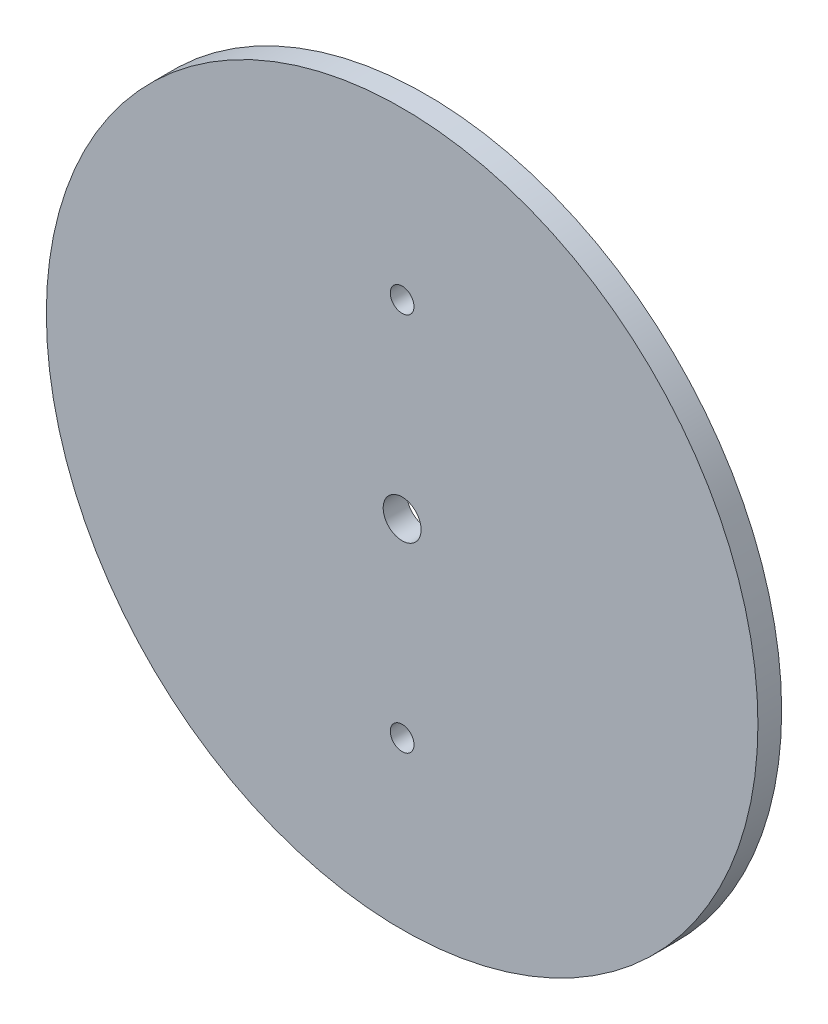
ISO-10303-21;
HEADER;
FILE_DESCRIPTION(('STEP AP214'),'2;1');
FILE_NAME('part.step','',(''),(''),'','','');
FILE_SCHEMA(('AUTOMOTIVE_DESIGN { 1 0 10303 214 1 1 1 1 }'));
ENDSEC;
DATA;
#1=APPLICATION_CONTEXT('core data for automotive mechanical design processes');
#2=APPLICATION_PROTOCOL_DEFINITION('international standard','automotive_design',2000,#1);
#3=PRODUCT_CONTEXT('',#1,'mechanical');
#4=PRODUCT('Part','Part','',(#3));
#5=PRODUCT_RELATED_PRODUCT_CATEGORY('part','',(#4));
#6=PRODUCT_DEFINITION_FORMATION('','',#4);
#7=PRODUCT_DEFINITION_CONTEXT('part definition',#1,'design');
#8=PRODUCT_DEFINITION('design','',#6,#7);
#9=PRODUCT_DEFINITION_SHAPE('','',#8);
#10=(LENGTH_UNIT() NAMED_UNIT(*) SI_UNIT(.MILLI.,.METRE.));
#11=(NAMED_UNIT(*) PLANE_ANGLE_UNIT() SI_UNIT($,.RADIAN.));
#12=(NAMED_UNIT(*) SI_UNIT($,.STERADIAN.) SOLID_ANGLE_UNIT());
#13=UNCERTAINTY_MEASURE_WITH_UNIT(LENGTH_MEASURE(1.E-05),#10,'distance_accuracy_value','');
#14=(GEOMETRIC_REPRESENTATION_CONTEXT(3) GLOBAL_UNCERTAINTY_ASSIGNED_CONTEXT((#13)) GLOBAL_UNIT_ASSIGNED_CONTEXT((#10,
#11,#12)) REPRESENTATION_CONTEXT('',''));
#15=CARTESIAN_POINT('',(0.,0.,0.));
#16=DIRECTION('',(0.,0.,1.));
#17=DIRECTION('',(1.,0.,0.));
#18=AXIS2_PLACEMENT_3D('',#15,#16,#17);
#19=CARTESIAN_POINT('',(0.,0.,65.));
#20=DIRECTION('',(0.,0.,1.));
#21=DIRECTION('',(1.,0.,0.));
#22=AXIS2_PLACEMENT_3D('',#19,#20,#21);
#23=CYLINDRICAL_SURFACE('',#22,75.);
#24=CARTESIAN_POINT('',(0.,0.,65.));
#25=DIRECTION('',(0.,0.,1.));
#26=DIRECTION('',(1.,0.,0.));
#27=AXIS2_PLACEMENT_3D('',#24,#25,#26);
#28=CIRCLE('',#27,75.);
#29=CARTESIAN_POINT('',(75.,0.,65.));
#30=VERTEX_POINT('',#29);
#31=EDGE_CURVE('E10',#30,#30,#28,.T.);
#32=ORIENTED_EDGE('',*,*,#31,.T.);
#33=EDGE_LOOP('',(#32));
#34=FACE_BOUND('',#33,.T.);
#35=CARTESIAN_POINT('',(0.,0.,70.));
#36=DIRECTION('',(0.,0.,1.));
#37=DIRECTION('',(1.,0.,0.));
#38=AXIS2_PLACEMENT_3D('',#35,#36,#37);
#39=CIRCLE('',#38,75.);
#40=CARTESIAN_POINT('',(75.,0.,70.));
#41=VERTEX_POINT('',#40);
#42=EDGE_CURVE('E40',#41,#41,#39,.T.);
#43=ORIENTED_EDGE('',*,*,#42,.F.);
#44=EDGE_LOOP('',(#43));
#45=FACE_BOUND('',#44,.T.);
#46=ADVANCED_FACE('F32',(#34,#45),#23,.T.);
#47=CARTESIAN_POINT('',(0.,0.,65.));
#48=DIRECTION('',(0.,0.,1.));
#49=DIRECTION('',(1.,0.,0.));
#50=AXIS2_PLACEMENT_3D('',#47,#48,#49);
#51=PLANE('',#50);
#52=CARTESIAN_POINT('',(0.,0.,65.));
#53=DIRECTION('',(0.,0.,-1.));
#54=DIRECTION('',(-1.,0.,0.));
#55=AXIS2_PLACEMENT_3D('',#52,#53,#54);
#56=CIRCLE('',#55,4.);
#57=CARTESIAN_POINT('',(-4.,0.,65.));
#58=VERTEX_POINT('',#57);
#59=EDGE_CURVE('E58',#58,#58,#56,.T.);
#60=ORIENTED_EDGE('',*,*,#59,.F.);
#61=EDGE_LOOP('',(#60));
#62=FACE_BOUND('',#61,.T.);
#63=CARTESIAN_POINT('',(0.,-40.,65.));
#64=DIRECTION('',(0.,0.,1.));
#65=DIRECTION('',(1.,0.,0.));
#66=AXIS2_PLACEMENT_3D('',#63,#64,#65);
#67=CIRCLE('',#66,2.5);
#68=CARTESIAN_POINT('',(2.5,-40.,65.));
#69=VERTEX_POINT('',#68);
#70=EDGE_CURVE('E52',#69,#69,#67,.F.);
#71=ORIENTED_EDGE('',*,*,#70,.F.);
#72=EDGE_LOOP('',(#71));
#73=FACE_BOUND('',#72,.T.);
#74=CARTESIAN_POINT('',(0.,40.,65.));
#75=DIRECTION('',(0.,0.,1.));
#76=DIRECTION('',(1.,0.,0.));
#77=AXIS2_PLACEMENT_3D('',#74,#75,#76);
#78=CIRCLE('',#77,2.5);
#79=CARTESIAN_POINT('',(2.5,40.,65.));
#80=VERTEX_POINT('',#79);
#81=EDGE_CURVE('E45',#80,#80,#78,.T.);
#82=ORIENTED_EDGE('',*,*,#81,.T.);
#83=EDGE_LOOP('',(#82));
#84=FACE_BOUND('',#83,.T.);
#85=ORIENTED_EDGE('',*,*,#31,.F.);
#86=EDGE_LOOP('',(#85));
#87=FACE_BOUND('',#86,.T.);
#88=ADVANCED_FACE('F70',(#62,#73,#84,#87),#51,.F.);
#89=CARTESIAN_POINT('',(0.,0.,70.));
#90=DIRECTION('',(0.,0.,1.));
#91=DIRECTION('',(1.,0.,0.));
#92=AXIS2_PLACEMENT_3D('',#89,#90,#91);
#93=PLANE('',#92);
#94=CARTESIAN_POINT('',(0.,0.,70.));
#95=DIRECTION('',(0.,0.,1.));
#96=DIRECTION('',(1.,0.,0.));
#97=AXIS2_PLACEMENT_3D('',#94,#95,#96);
#98=CIRCLE('',#97,4.);
#99=CARTESIAN_POINT('',(4.,0.,70.));
#100=VERTEX_POINT('',#99);
#101=EDGE_CURVE('E36',#100,#100,#98,.T.);
#102=ORIENTED_EDGE('',*,*,#101,.F.);
#103=EDGE_LOOP('',(#102));
#104=FACE_BOUND('',#103,.T.);
#105=CARTESIAN_POINT('',(0.,-40.,70.));
#106=DIRECTION('',(0.,0.,1.));
#107=DIRECTION('',(1.,0.,0.));
#108=AXIS2_PLACEMENT_3D('',#105,#106,#107);
#109=CIRCLE('',#108,2.5);
#110=CARTESIAN_POINT('',(2.5,-40.,70.));
#111=VERTEX_POINT('',#110);
#112=EDGE_CURVE('E55',#111,#111,#109,.F.);
#113=ORIENTED_EDGE('',*,*,#112,.T.);
#114=EDGE_LOOP('',(#113));
#115=FACE_BOUND('',#114,.T.);
#116=CARTESIAN_POINT('',(0.,40.,70.));
#117=DIRECTION('',(0.,0.,1.));
#118=DIRECTION('',(1.,0.,0.));
#119=AXIS2_PLACEMENT_3D('',#116,#117,#118);
#120=CIRCLE('',#119,2.5);
#121=CARTESIAN_POINT('',(2.5,40.,70.));
#122=VERTEX_POINT('',#121);
#123=EDGE_CURVE('E49',#122,#122,#120,.T.);
#124=ORIENTED_EDGE('',*,*,#123,.F.);
#125=EDGE_LOOP('',(#124));
#126=FACE_BOUND('',#125,.T.);
#127=ORIENTED_EDGE('',*,*,#42,.T.);
#128=EDGE_LOOP('',(#127));
#129=FACE_BOUND('',#128,.T.);
#130=ADVANCED_FACE('F34',(#104,#115,#126,#129),#93,.T.);
#131=CARTESIAN_POINT('',(0.,40.,130.));
#132=DIRECTION('',(0.,0.,-1.));
#133=DIRECTION('',(-1.,0.,0.));
#134=AXIS2_PLACEMENT_3D('',#131,#132,#133);
#135=CYLINDRICAL_SURFACE('',#134,2.5);
#136=ORIENTED_EDGE('',*,*,#123,.T.);
#137=EDGE_LOOP('',(#136));
#138=FACE_BOUND('',#137,.T.);
#139=ORIENTED_EDGE('',*,*,#81,.F.);
#140=EDGE_LOOP('',(#139));
#141=FACE_BOUND('',#140,.T.);
#142=ADVANCED_FACE('F69',(#138,#141),#135,.F.);
#143=CARTESIAN_POINT('',(0.,-40.,130.));
#144=DIRECTION('',(0.,0.,-1.));
#145=DIRECTION('',(-1.,0.,0.));
#146=AXIS2_PLACEMENT_3D('',#143,#144,#145);
#147=CYLINDRICAL_SURFACE('',#146,2.5);
#148=ORIENTED_EDGE('',*,*,#112,.F.);
#149=EDGE_LOOP('',(#148));
#150=FACE_BOUND('',#149,.T.);
#151=ORIENTED_EDGE('',*,*,#70,.T.);
#152=EDGE_LOOP('',(#151));
#153=FACE_BOUND('',#152,.T.);
#154=ADVANCED_FACE('F87',(#150,#153),#147,.F.);
#155=CARTESIAN_POINT('',(0.,0.,185.));
#156=DIRECTION('',(0.,0.,-1.));
#157=DIRECTION('',(-1.,0.,0.));
#158=AXIS2_PLACEMENT_3D('',#155,#156,#157);
#159=CYLINDRICAL_SURFACE('',#158,4.);
#160=ORIENTED_EDGE('',*,*,#101,.T.);
#161=EDGE_LOOP('',(#160));
#162=FACE_BOUND('',#161,.T.);
#163=ORIENTED_EDGE('',*,*,#59,.T.);
#164=EDGE_LOOP('',(#163));
#165=FACE_BOUND('',#164,.T.);
#166=ADVANCED_FACE('F65',(#162,#165),#159,.F.);
#167=CLOSED_SHELL('',(#46,#88,#130,#142,#154,#166));
#168=MANIFOLD_SOLID_BREP('B2',#167);
#169=ADVANCED_BREP_SHAPE_REPRESENTATION('',(#18,#168),#14);
#170=SHAPE_DEFINITION_REPRESENTATION(#9,#169);
ENDSEC;
END-ISO-10303-21;
